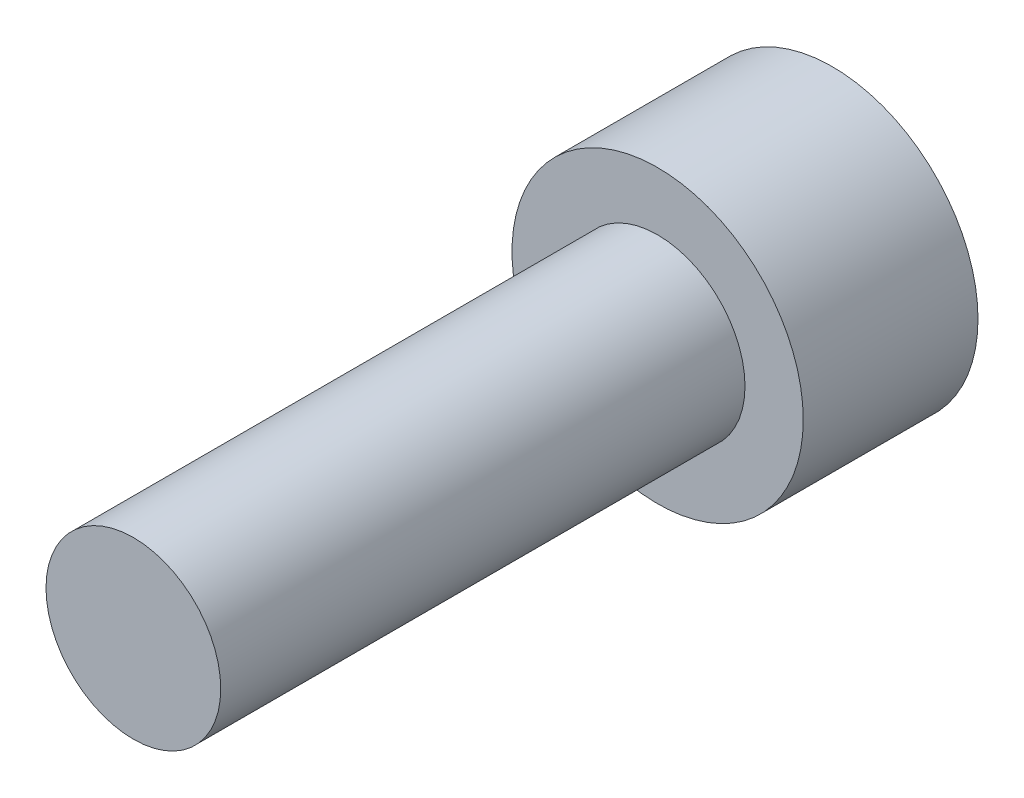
from build123d import *

# Parameters (mm, degrees)
HEX_2_DEPTH = 5


with BuildPart() as part:
    # Sketch6 → Revolve1 (revolve)
    with BuildSketch(Plane(origin=(0, 0, 0), x_dir=(0, 0, -1), z_dir=(1, 0, 0)), mode=Mode.PRIVATE) as revolve1_sk:
        Polygon((-18, 0), (-18, -3), (0, -3), (0, -5), (6, -5), (6, 0), align=None)
    revolve(revolve1_sk.sketch.rotate(Axis((0, 0, 18), (0, 0, -1)), 270), axis=Axis((0, 0, 18), (0, 0, -1)))

    # Sketch7 → HEX 2 (cut)
    with BuildSketch(Plane(origin=(0, 0, -6), x_dir=(-1, 0, 0), z_dir=(0, 0, -1))):
        Polygon((-2.5, 1.443375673), (-2.5, -1.443375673), (0, -2.886751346), (2.5, -1.443375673), (2.5, 1.443375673), (0, 2.886751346), align=None)
    extrude(amount=-HEX_2_DEPTH, mode=Mode.SUBTRACT)


solid = part.part
